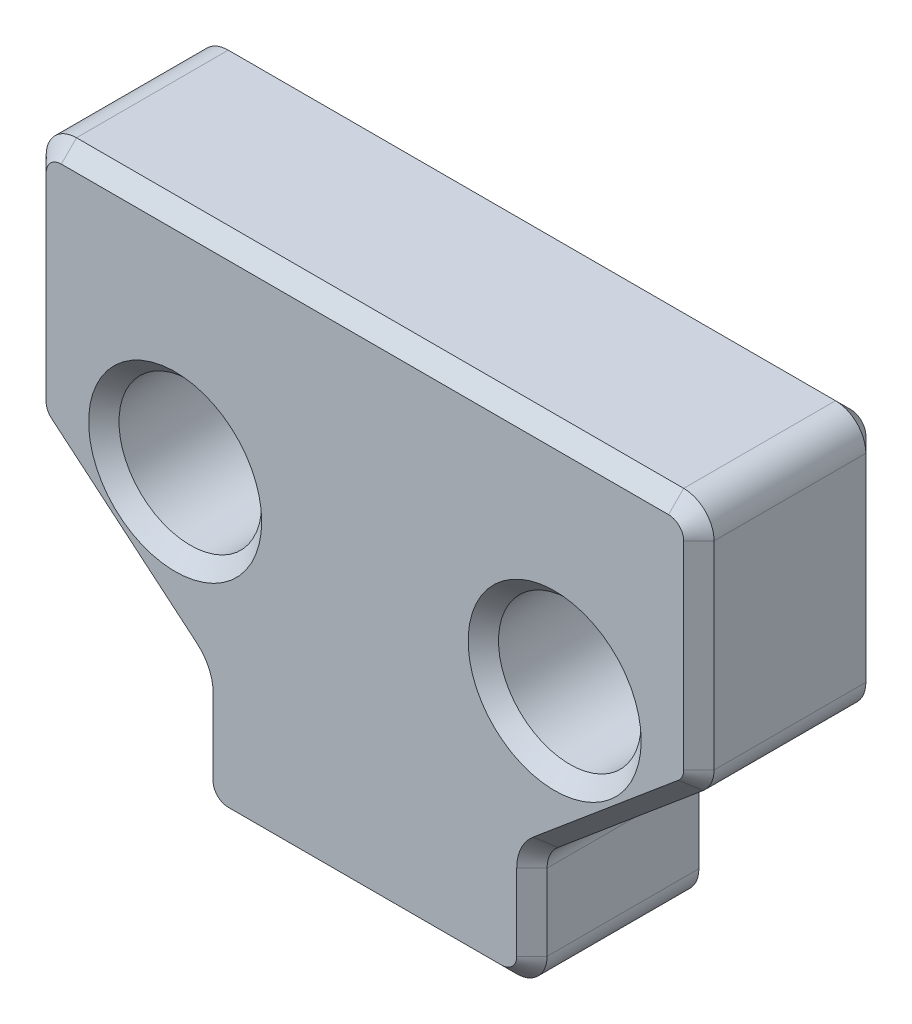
from build123d import *

# Parameters (mm, degrees)
DODANIE_WYCI_GNI_CIE1_DEPTH = 6
SZKIC2_R                    = 1.7
WYTNIJ_WYCI_GNI_CIE1_DEPTH  = 25.162160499
ZAOKR_GLENIE1_R             = 1
OTW_R_4_7_4_7_2_D           = 4.7
OTW_R_4_7_4_7_2_DEPTH       = 5
OTW_R_4_7_4_7_2_TIP         = 1.412022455
SFAZOWANIE1_SIZE            = 0.5


with BuildPart() as part:
    # Szkic1 → Dodanie-wyci_gni_cie1 (new body)
    with BuildSketch(Plane.XY):
        Polygon((0, 0), (0, 3.984952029), (-5.5, 8.6), (-5.5, 16.6), (16.5, 16.6), (16.5, 8.6), (11, 3.984952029), (11, 0), align=None)
    extrude(amount=DODANIE_WYCI_GNI_CIE1_DEPTH)

    # Szkic2 → Wytnij-wyci_gni_cie1 (cut, through all)
    with BuildSketch(Plane.XY.offset(6)):
        with Locations((-0.75, 9.2)):
            Circle(SZKIC2_R)
        with Locations((11.75, 9.2)):
            Circle(SZKIC2_R)
    extrude(amount=-WYTNIJ_WYCI_GNI_CIE1_DEPTH, mode=Mode.SUBTRACT)

    # Zaokr_glenie1
    zaokr_glenie1_edges = [part.edges().sort_by_distance(p)[0] for p in [
        (0, 0, 3),
        (0, 3.984952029, 3),
        (-5.5, 8.6, 3),
        (-5.5, 16.6, 3),
        (16.5, 16.6, 3),
        (16.5, 8.6, 3),
        (11, 3.984952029, 3),
        (11, 0, 3),
    ]]
    fillet(zaokr_glenie1_edges, radius=ZAOKR_GLENIE1_R)

    # Otw_r _4.7 _4.7_2
    with Locations(Plane.XY.offset(6)):
        with Locations((-0.75, 9.2), (11.75, 9.2)):
            Hole(OTW_R_4_7_4_7_2_D / 2, depth=OTW_R_4_7_4_7_2_DEPTH)
            with Locations((0, 0, -(OTW_R_4_7_4_7_2_DEPTH + OTW_R_4_7_4_7_2_TIP / 2))):  # 118° drill point
                Cone(0, OTW_R_4_7_4_7_2_D / 2, OTW_R_4_7_4_7_2_TIP, mode=Mode.SUBTRACT)

    # Sfazowanie1
    sfazowanie1_edges = [part.edges().sort_by_distance(p)[0] for p in [
        (-2.75, 6.292476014, 0),
        (-2.75, 6.292476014, 6),
        (5.5, 0, 0),
        (0, 2.259322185, 0),
        (-5.5, 12.333153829, 0),
        (5.5, 16.6, 0),
        (16.5, 12.333153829, 0),
        (13.75, 6.292476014, 0),
        (11, 2.259322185, 0),
        (16.207106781, 16.307106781, 0),
        (-5.207106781, 16.307106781, 0),
        (16.406307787, 8.643689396, 0),
        (10.707106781, 0.292893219, 0),
        (0.292893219, 0.292893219, 0),
        (-5.406307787, 8.643689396, 0),
        (-5.5, 12.333153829, 6),
        (5.5, 0, 6),
        (11, 2.259322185, 6),
        (13.75, 6.292476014, 6),
        (16.5, 12.333153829, 6),
        (5.5, 16.6, 6),
        (0, 2.259322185, 6),
        (16.207106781, 16.307106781, 6),
        (-5.207106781, 16.307106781, 6),
        (16.406307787, 8.643689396, 6),
        (10.707106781, 0.292893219, 6),
        (0.292893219, 0.292893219, 6),
        (-5.406307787, 8.643689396, 6),
        (-0.093692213, 3.941262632, 0),
        (-0.093692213, 3.941262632, 6),
        (11.093692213, 3.941262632, 0),
        (11.093692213, 3.941262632, 6),
        (14.1, 9.2, 6),
        (1.6, 9.2, 6),
    ]]
    chamfer(sfazowanie1_edges, length=SFAZOWANIE1_SIZE)


solid = part.part
